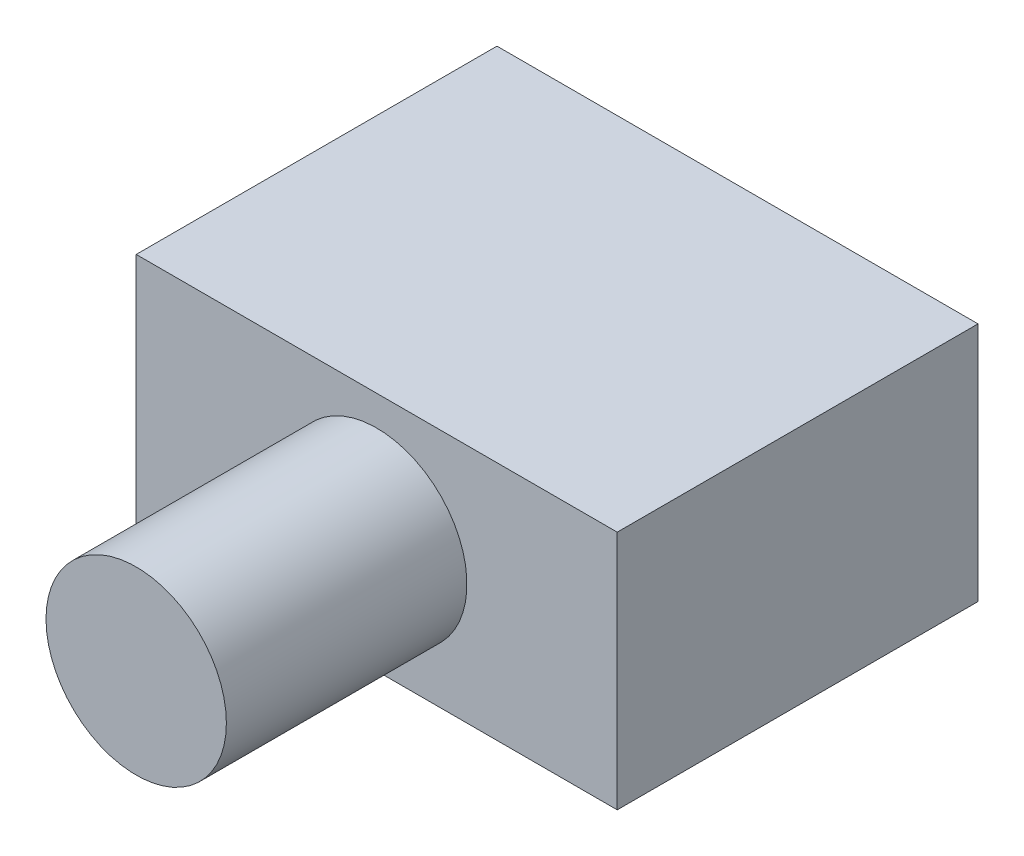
ISO-10303-21;
HEADER;
FILE_DESCRIPTION(('STEP AP214'),'2;1');
FILE_NAME('part.step','',(''),(''),'','','');
FILE_SCHEMA(('AUTOMOTIVE_DESIGN { 1 0 10303 214 1 1 1 1 }'));
ENDSEC;
DATA;
#1=APPLICATION_CONTEXT('core data for automotive mechanical design processes');
#2=APPLICATION_PROTOCOL_DEFINITION('international standard','automotive_design',2000,#1);
#3=PRODUCT_CONTEXT('',#1,'mechanical');
#4=PRODUCT('Part','Part','',(#3));
#5=PRODUCT_RELATED_PRODUCT_CATEGORY('part','',(#4));
#6=PRODUCT_DEFINITION_FORMATION('','',#4);
#7=PRODUCT_DEFINITION_CONTEXT('part definition',#1,'design');
#8=PRODUCT_DEFINITION('design','',#6,#7);
#9=PRODUCT_DEFINITION_SHAPE('','',#8);
#10=(LENGTH_UNIT() NAMED_UNIT(*) SI_UNIT(.MILLI.,.METRE.));
#11=(NAMED_UNIT(*) PLANE_ANGLE_UNIT() SI_UNIT($,.RADIAN.));
#12=(NAMED_UNIT(*) SI_UNIT($,.STERADIAN.) SOLID_ANGLE_UNIT());
#13=UNCERTAINTY_MEASURE_WITH_UNIT(LENGTH_MEASURE(1.E-05),#10,'distance_accuracy_value','');
#14=(GEOMETRIC_REPRESENTATION_CONTEXT(3) GLOBAL_UNCERTAINTY_ASSIGNED_CONTEXT((#13)) GLOBAL_UNIT_ASSIGNED_CONTEXT((#10,
#11,#12)) REPRESENTATION_CONTEXT('',''));
#15=CARTESIAN_POINT('',(0.,0.,0.));
#16=DIRECTION('',(0.,0.,1.));
#17=DIRECTION('',(1.,0.,0.));
#18=AXIS2_PLACEMENT_3D('',#15,#16,#17);
#19=CARTESIAN_POINT('',(0.,0.,12.7));
#20=DIRECTION('',(0.,0.,-1.));
#21=DIRECTION('',(-1.,0.,0.));
#22=AXIS2_PLACEMENT_3D('',#19,#20,#21);
#23=CYLINDRICAL_SURFACE('',#22,9.525);
#24=CARTESIAN_POINT('',(0.,0.,12.7));
#25=DIRECTION('',(0.,0.,1.));
#26=DIRECTION('',(1.,0.,0.));
#27=AXIS2_PLACEMENT_3D('',#24,#25,#26);
#28=CIRCLE('',#27,9.525);
#29=CARTESIAN_POINT('',(9.525,0.,12.7));
#30=VERTEX_POINT('',#29);
#31=EDGE_CURVE('E11',#30,#30,#28,.T.);
#32=ORIENTED_EDGE('',*,*,#31,.F.);
#33=EDGE_LOOP('',(#32));
#34=FACE_BOUND('',#33,.T.);
#35=CARTESIAN_POINT('',(0.,0.,-12.7));
#36=DIRECTION('',(0.,0.,-1.));
#37=DIRECTION('',(-1.,0.,0.));
#38=AXIS2_PLACEMENT_3D('',#35,#36,#37);
#39=CIRCLE('',#38,9.525);
#40=CARTESIAN_POINT('',(-9.525,0.,-12.7));
#41=VERTEX_POINT('',#40);
#42=EDGE_CURVE('E35',#41,#41,#39,.T.);
#43=ORIENTED_EDGE('',*,*,#42,.F.);
#44=EDGE_LOOP('',(#43));
#45=FACE_BOUND('',#44,.T.);
#46=ADVANCED_FACE('F28',(#34,#45),#23,.T.);
#47=CARTESIAN_POINT('',(0.,0.,12.7));
#48=DIRECTION('',(0.,0.,1.));
#49=DIRECTION('',(1.,0.,0.));
#50=AXIS2_PLACEMENT_3D('',#47,#48,#49);
#51=PLANE('',#50);
#52=ORIENTED_EDGE('',*,*,#31,.T.);
#53=EDGE_LOOP('',(#52));
#54=FACE_BOUND('',#53,.T.);
#55=ADVANCED_FACE('F109',(#54),#51,.T.);
#56=CARTESIAN_POINT('',(-25.4,12.7,-12.7));
#57=DIRECTION('',(0.,0.,-1.));
#58=DIRECTION('',(-1.,0.,0.));
#59=AXIS2_PLACEMENT_3D('',#56,#57,#58);
#60=PLANE('',#59);
#61=DIRECTION('',(0.,1.,0.));
#62=VECTOR('',#61,1.);
#63=CARTESIAN_POINT('',(-25.4,-12.7,-12.7));
#64=LINE('',#63,#62);
#65=CARTESIAN_POINT('',(-25.4,-12.7,-12.7));
#66=VERTEX_POINT('',#65);
#67=CARTESIAN_POINT('',(-25.4,12.7,-12.7));
#68=VERTEX_POINT('',#67);
#69=EDGE_CURVE('E74',#66,#68,#64,.T.);
#70=ORIENTED_EDGE('',*,*,#69,.F.);
#71=DIRECTION('',(-1.,0.,0.));
#72=VECTOR('',#71,1.);
#73=CARTESIAN_POINT('',(-25.4,-12.7,-12.7));
#74=LINE('',#73,#72);
#75=CARTESIAN_POINT('',(25.4,-12.7,-12.7));
#76=VERTEX_POINT('',#75);
#77=EDGE_CURVE('E94',#76,#66,#74,.T.);
#78=ORIENTED_EDGE('',*,*,#77,.F.);
#79=DIRECTION('',(0.,-1.,0.));
#80=VECTOR('',#79,1.);
#81=CARTESIAN_POINT('',(25.4,-12.7,-12.7));
#82=LINE('',#81,#80);
#83=CARTESIAN_POINT('',(25.4,12.7,-12.7));
#84=VERTEX_POINT('',#83);
#85=EDGE_CURVE('E75',#84,#76,#82,.T.);
#86=ORIENTED_EDGE('',*,*,#85,.F.);
#87=DIRECTION('',(1.,0.,0.));
#88=VECTOR('',#87,1.);
#89=CARTESIAN_POINT('',(-25.4,12.7,-12.7));
#90=LINE('',#89,#88);
#91=EDGE_CURVE('E68',#68,#84,#90,.T.);
#92=ORIENTED_EDGE('',*,*,#91,.F.);
#93=EDGE_LOOP('',(#70,#78,#86,#92));
#94=FACE_BOUND('',#93,.T.);
#95=ORIENTED_EDGE('',*,*,#42,.T.);
#96=EDGE_LOOP('',(#95));
#97=FACE_BOUND('',#96,.T.);
#98=ADVANCED_FACE('F70',(#94,#97),#60,.F.);
#99=CARTESIAN_POINT('',(-25.4,-12.7,-50.8));
#100=DIRECTION('',(1.,0.,0.));
#101=DIRECTION('',(0.,0.,-1.));
#102=AXIS2_PLACEMENT_3D('',#99,#100,#101);
#103=PLANE('',#102);
#104=ORIENTED_EDGE('',*,*,#69,.T.);
#105=DIRECTION('',(0.,0.,1.));
#106=VECTOR('',#105,1.);
#107=CARTESIAN_POINT('',(-25.4,12.7,-50.8));
#108=LINE('',#107,#106);
#109=CARTESIAN_POINT('',(-25.4,12.7,-50.8));
#110=VERTEX_POINT('',#109);
#111=EDGE_CURVE('E81',#110,#68,#108,.T.);
#112=ORIENTED_EDGE('',*,*,#111,.F.);
#113=DIRECTION('',(0.,1.,0.));
#114=VECTOR('',#113,1.);
#115=CARTESIAN_POINT('',(-25.4,-12.7,-50.8));
#116=LINE('',#115,#114);
#117=CARTESIAN_POINT('',(-25.4,-12.7,-50.8));
#118=VERTEX_POINT('',#117);
#119=EDGE_CURVE('E96',#118,#110,#116,.T.);
#120=ORIENTED_EDGE('',*,*,#119,.F.);
#121=DIRECTION('',(0.,0.,1.));
#122=VECTOR('',#121,1.);
#123=CARTESIAN_POINT('',(-25.4,-12.7,-50.8));
#124=LINE('',#123,#122);
#125=EDGE_CURVE('E90',#118,#66,#124,.T.);
#126=ORIENTED_EDGE('',*,*,#125,.T.);
#127=EDGE_LOOP('',(#104,#112,#120,#126));
#128=FACE_BOUND('',#127,.T.);
#129=ADVANCED_FACE('F89',(#128),#103,.F.);
#130=CARTESIAN_POINT('',(-25.4,12.7,-50.8));
#131=DIRECTION('',(0.,-1.,0.));
#132=DIRECTION('',(1.,0.,0.));
#133=AXIS2_PLACEMENT_3D('',#130,#131,#132);
#134=PLANE('',#133);
#135=ORIENTED_EDGE('',*,*,#91,.T.);
#136=DIRECTION('',(0.,0.,1.));
#137=VECTOR('',#136,1.);
#138=CARTESIAN_POINT('',(25.4,12.7,-50.8));
#139=LINE('',#138,#137);
#140=CARTESIAN_POINT('',(25.4,12.7,-50.8));
#141=VERTEX_POINT('',#140);
#142=EDGE_CURVE('E86',#141,#84,#139,.T.);
#143=ORIENTED_EDGE('',*,*,#142,.F.);
#144=DIRECTION('',(1.,0.,0.));
#145=VECTOR('',#144,1.);
#146=CARTESIAN_POINT('',(-25.4,12.7,-50.8));
#147=LINE('',#146,#145);
#148=EDGE_CURVE('E83',#110,#141,#147,.T.);
#149=ORIENTED_EDGE('',*,*,#148,.F.);
#150=ORIENTED_EDGE('',*,*,#111,.T.);
#151=EDGE_LOOP('',(#135,#143,#149,#150));
#152=FACE_BOUND('',#151,.T.);
#153=ADVANCED_FACE('F82',(#152),#134,.F.);
#154=CARTESIAN_POINT('',(25.4,-12.7,-50.8));
#155=DIRECTION('',(-1.,0.,0.));
#156=DIRECTION('',(0.,0.,1.));
#157=AXIS2_PLACEMENT_3D('',#154,#155,#156);
#158=PLANE('',#157);
#159=ORIENTED_EDGE('',*,*,#85,.T.);
#160=DIRECTION('',(0.,0.,1.));
#161=VECTOR('',#160,1.);
#162=CARTESIAN_POINT('',(25.4,-12.7,-50.8));
#163=LINE('',#162,#161);
#164=CARTESIAN_POINT('',(25.4,-12.7,-50.8));
#165=VERTEX_POINT('',#164);
#166=EDGE_CURVE('E102',#165,#76,#163,.T.);
#167=ORIENTED_EDGE('',*,*,#166,.F.);
#168=DIRECTION('',(0.,-1.,0.));
#169=VECTOR('',#168,1.);
#170=CARTESIAN_POINT('',(25.4,-12.7,-50.8));
#171=LINE('',#170,#169);
#172=EDGE_CURVE('E47',#141,#165,#171,.T.);
#173=ORIENTED_EDGE('',*,*,#172,.F.);
#174=ORIENTED_EDGE('',*,*,#142,.T.);
#175=EDGE_LOOP('',(#159,#167,#173,#174));
#176=FACE_BOUND('',#175,.T.);
#177=ADVANCED_FACE('F125',(#176),#158,.F.);
#178=CARTESIAN_POINT('',(-25.4,-12.7,-50.8));
#179=DIRECTION('',(0.,1.,0.));
#180=DIRECTION('',(-1.,0.,0.));
#181=AXIS2_PLACEMENT_3D('',#178,#179,#180);
#182=PLANE('',#181);
#183=ORIENTED_EDGE('',*,*,#77,.T.);
#184=ORIENTED_EDGE('',*,*,#125,.F.);
#185=DIRECTION('',(-1.,0.,0.));
#186=VECTOR('',#185,1.);
#187=CARTESIAN_POINT('',(-25.4,-12.7,-50.8));
#188=LINE('',#187,#186);
#189=EDGE_CURVE('E42',#165,#118,#188,.T.);
#190=ORIENTED_EDGE('',*,*,#189,.F.);
#191=ORIENTED_EDGE('',*,*,#166,.T.);
#192=EDGE_LOOP('',(#183,#184,#190,#191));
#193=FACE_BOUND('',#192,.T.);
#194=ADVANCED_FACE('F128',(#193),#182,.F.);
#195=CARTESIAN_POINT('',(-25.4,12.7,-50.8));
#196=DIRECTION('',(0.,0.,-1.));
#197=DIRECTION('',(-1.,0.,0.));
#198=AXIS2_PLACEMENT_3D('',#195,#196,#197);
#199=PLANE('',#198);
#200=ORIENTED_EDGE('',*,*,#119,.T.);
#201=ORIENTED_EDGE('',*,*,#148,.T.);
#202=ORIENTED_EDGE('',*,*,#172,.T.);
#203=ORIENTED_EDGE('',*,*,#189,.T.);
#204=EDGE_LOOP('',(#200,#201,#202,#203));
#205=FACE_BOUND('',#204,.T.);
#206=ADVANCED_FACE('F132',(#205),#199,.T.);
#207=CLOSED_SHELL('',(#46,#55,#98,#129,#153,#177,#194,#206));
#208=MANIFOLD_SOLID_BREP('B2',#207);
#209=ADVANCED_BREP_SHAPE_REPRESENTATION('',(#18,#208),#14);
#210=SHAPE_DEFINITION_REPRESENTATION(#9,#209);
ENDSEC;
END-ISO-10303-21;
